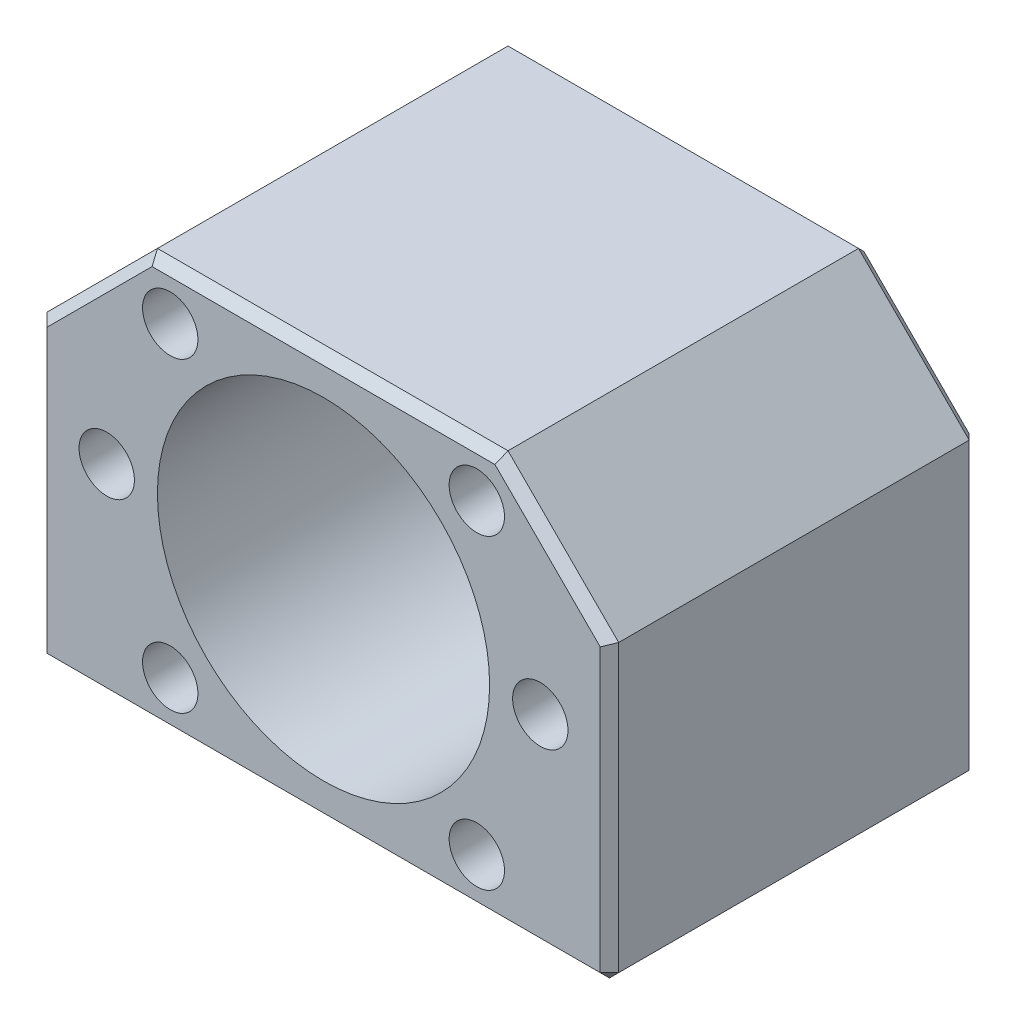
ISO-10303-21;
HEADER;
FILE_DESCRIPTION(('STEP AP214'),'2;1');
FILE_NAME('part.step','',(''),(''),'','','');
FILE_SCHEMA(('AUTOMOTIVE_DESIGN { 1 0 10303 214 1 1 1 1 }'));
ENDSEC;
DATA;
#1=APPLICATION_CONTEXT('core data for automotive mechanical design processes');
#2=APPLICATION_PROTOCOL_DEFINITION('international standard','automotive_design',2000,#1);
#3=PRODUCT_CONTEXT('',#1,'mechanical');
#4=PRODUCT('Part','Part','',(#3));
#5=PRODUCT_RELATED_PRODUCT_CATEGORY('part','',(#4));
#6=PRODUCT_DEFINITION_FORMATION('','',#4);
#7=PRODUCT_DEFINITION_CONTEXT('part definition',#1,'design');
#8=PRODUCT_DEFINITION('design','',#6,#7);
#9=PRODUCT_DEFINITION_SHAPE('','',#8);
#10=(LENGTH_UNIT() NAMED_UNIT(*) SI_UNIT(.MILLI.,.METRE.));
#11=(NAMED_UNIT(*) PLANE_ANGLE_UNIT() SI_UNIT($,.RADIAN.));
#12=(NAMED_UNIT(*) SI_UNIT($,.STERADIAN.) SOLID_ANGLE_UNIT());
#13=UNCERTAINTY_MEASURE_WITH_UNIT(LENGTH_MEASURE(1.E-05),#10,'distance_accuracy_value','');
#14=(GEOMETRIC_REPRESENTATION_CONTEXT(3) GLOBAL_UNCERTAINTY_ASSIGNED_CONTEXT((#13)) GLOBAL_UNIT_ASSIGNED_CONTEXT((#10,
#11,#12)) REPRESENTATION_CONTEXT('',''));
#15=CARTESIAN_POINT('',(0.,0.,0.));
#16=DIRECTION('',(0.,0.,1.));
#17=DIRECTION('',(1.,0.,0.));
#18=AXIS2_PLACEMENT_3D('',#15,#16,#17);
#19=CARTESIAN_POINT('',(-31.,-22.,0.));
#20=DIRECTION('',(-1.,0.,0.));
#21=DIRECTION('',(0.,0.,1.));
#22=AXIS2_PLACEMENT_3D('',#19,#20,#21);
#23=PLANE('',#22);
#24=DIRECTION('',(0.,-1.,0.));
#25=VECTOR('',#24,1.);
#26=CARTESIAN_POINT('',(-31.,-11.,-1.));
#27=LINE('',#26,#25);
#28=CARTESIAN_POINT('',(-31.,10.,-1.));
#29=VERTEX_POINT('',#28);
#30=CARTESIAN_POINT('',(-31.,-21.,-1.));
#31=VERTEX_POINT('',#30);
#32=EDGE_CURVE('E376',#29,#31,#27,.T.);
#33=ORIENTED_EDGE('',*,*,#32,.F.);
#34=DIRECTION('',(0.,0.,1.));
#35=VECTOR('',#34,1.);
#36=CARTESIAN_POINT('',(-31.,10.,0.));
#37=LINE('',#36,#35);
#38=CARTESIAN_POINT('',(-31.,10.,-39.));
#39=VERTEX_POINT('',#38);
#40=EDGE_CURVE('E154',#39,#29,#37,.T.);
#41=ORIENTED_EDGE('',*,*,#40,.F.);
#42=DIRECTION('',(0.,1.,0.));
#43=VECTOR('',#42,1.);
#44=CARTESIAN_POINT('',(-31.,-11.,-39.));
#45=LINE('',#44,#43);
#46=CARTESIAN_POINT('',(-31.,-21.,-39.));
#47=VERTEX_POINT('',#46);
#48=EDGE_CURVE('E418',#47,#39,#45,.T.);
#49=ORIENTED_EDGE('',*,*,#48,.F.);
#50=DIRECTION('',(0.,0.,-1.));
#51=VECTOR('',#50,1.);
#52=CARTESIAN_POINT('',(-31.,-21.,0.));
#53=LINE('',#52,#51);
#54=EDGE_CURVE('E392',#31,#47,#53,.T.);
#55=ORIENTED_EDGE('',*,*,#54,.F.);
#56=EDGE_LOOP('',(#33,#41,#49,#55));
#57=FACE_BOUND('',#56,.T.);
#58=ADVANCED_FACE('F15',(#57),#23,.T.);
#59=CARTESIAN_POINT('',(0.,0.,0.));
#60=DIRECTION('',(0.,0.,-1.));
#61=DIRECTION('',(1.,0.,0.));
#62=AXIS2_PLACEMENT_3D('',#59,#60,#61);
#63=CYLINDRICAL_SURFACE('',#62,18.005);
#64=CARTESIAN_POINT('',(0.,0.,0.));
#65=DIRECTION('',(0.,0.,-1.));
#66=DIRECTION('',(1.,0.,0.));
#67=AXIS2_PLACEMENT_3D('',#64,#65,#66);
#68=CIRCLE('',#67,18.005);
#69=CARTESIAN_POINT('',(18.005,0.,0.));
#70=VERTEX_POINT('',#69);
#71=CARTESIAN_POINT('',(-18.005,0.,0.));
#72=VERTEX_POINT('',#71);
#73=EDGE_CURVE('E173',#70,#72,#68,.T.);
#74=ORIENTED_EDGE('',*,*,#73,.F.);
#75=CARTESIAN_POINT('',(0.,0.,0.));
#76=DIRECTION('',(0.,0.,-1.));
#77=DIRECTION('',(1.,0.,0.));
#78=AXIS2_PLACEMENT_3D('',#75,#76,#77);
#79=CIRCLE('',#78,18.005);
#80=EDGE_CURVE('E177',#72,#70,#79,.T.);
#81=ORIENTED_EDGE('',*,*,#80,.F.);
#82=DIRECTION('',(0.,0.,-1.));
#83=VECTOR('',#82,1.);
#84=CARTESIAN_POINT('',(-18.005,0.,0.));
#85=LINE('',#84,#83);
#86=CARTESIAN_POINT('',(-18.005,0.,-40.));
#87=VERTEX_POINT('',#86);
#88=EDGE_CURVE('E9',#72,#87,#85,.T.);
#89=ORIENTED_EDGE('',*,*,#88,.T.);
#90=CARTESIAN_POINT('',(0.,0.,-40.));
#91=DIRECTION('',(0.,0.,1.));
#92=DIRECTION('',(1.,0.,0.));
#93=AXIS2_PLACEMENT_3D('',#90,#91,#92);
#94=CIRCLE('',#93,18.005);
#95=EDGE_CURVE('E169',#87,#87,#94,.T.);
#96=ORIENTED_EDGE('',*,*,#95,.F.);
#97=ORIENTED_EDGE('',*,*,#88,.F.);
#98=EDGE_LOOP('',(#74,#81,#89,#96,#97));
#99=FACE_BOUND('',#98,.T.);
#100=ADVANCED_FACE('F1027',(#99),#63,.F.);
#101=CARTESIAN_POINT('',(-16.6170093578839,16.6170093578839,-15.));
#102=DIRECTION('',(0.,0.,1.));
#103=DIRECTION('',(1.,0.,0.));
#104=AXIS2_PLACEMENT_3D('',#101,#102,#103);
#105=PLANE('',#104);
#106=CARTESIAN_POINT('',(-16.6170093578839,16.6170093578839,-15.));
#107=DIRECTION('',(0.,0.,-1.));
#108=DIRECTION('',(1.,0.,0.));
#109=AXIS2_PLACEMENT_3D('',#106,#107,#108);
#110=CIRCLE('',#109,3.);
#111=CARTESIAN_POINT('',(-13.6170093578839,16.6170093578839,-15.));
#112=VERTEX_POINT('',#111);
#113=CARTESIAN_POINT('',(-19.6170093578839,16.6170093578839,-15.));
#114=VERTEX_POINT('',#113);
#115=EDGE_CURVE('E25',#112,#114,#110,.T.);
#116=ORIENTED_EDGE('',*,*,#115,.F.);
#117=CARTESIAN_POINT('',(-16.6170093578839,16.6170093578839,-15.));
#118=DIRECTION('',(0.,0.,-1.));
#119=DIRECTION('',(1.,0.,0.));
#120=AXIS2_PLACEMENT_3D('',#117,#118,#119);
#121=CIRCLE('',#120,3.);
#122=EDGE_CURVE('E18',#114,#112,#121,.T.);
#123=ORIENTED_EDGE('',*,*,#122,.F.);
#124=EDGE_LOOP('',(#116,#123));
#125=FACE_BOUND('',#124,.T.);
#126=ADVANCED_FACE('F1035',(#125),#105,.T.);
#127=CARTESIAN_POINT('',(-16.6170093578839,16.6170093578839,0.));
#128=DIRECTION('',(0.,0.,-1.));
#129=DIRECTION('',(1.,0.,0.));
#130=AXIS2_PLACEMENT_3D('',#127,#128,#129);
#131=CYLINDRICAL_SURFACE('',#130,3.);
#132=CARTESIAN_POINT('',(-16.6170093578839,16.6170093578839,0.));
#133=DIRECTION('',(0.,0.,-1.));
#134=DIRECTION('',(1.,0.,0.));
#135=AXIS2_PLACEMENT_3D('',#132,#133,#134);
#136=CIRCLE('',#135,3.);
#137=CARTESIAN_POINT('',(-13.6170093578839,16.6170093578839,0.));
#138=VERTEX_POINT('',#137);
#139=CARTESIAN_POINT('',(-19.6170093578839,16.6170093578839,0.));
#140=VERTEX_POINT('',#139);
#141=EDGE_CURVE('E187',#138,#140,#136,.T.);
#142=ORIENTED_EDGE('',*,*,#141,.F.);
#143=CARTESIAN_POINT('',(-16.6170093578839,16.6170093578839,0.));
#144=DIRECTION('',(0.,0.,-1.));
#145=DIRECTION('',(1.,0.,0.));
#146=AXIS2_PLACEMENT_3D('',#143,#144,#145);
#147=CIRCLE('',#146,3.);
#148=EDGE_CURVE('E191',#140,#138,#147,.T.);
#149=ORIENTED_EDGE('',*,*,#148,.F.);
#150=DIRECTION('',(0.,0.,-1.));
#151=VECTOR('',#150,1.);
#152=CARTESIAN_POINT('',(-19.6170093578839,16.6170093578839,0.));
#153=LINE('',#152,#151);
#154=EDGE_CURVE('E132',#140,#114,#153,.T.);
#155=ORIENTED_EDGE('',*,*,#154,.T.);
#156=ORIENTED_EDGE('',*,*,#122,.T.);
#157=ORIENTED_EDGE('',*,*,#115,.T.);
#158=ORIENTED_EDGE('',*,*,#154,.F.);
#159=EDGE_LOOP('',(#142,#149,#155,#156,#157,#158));
#160=FACE_BOUND('',#159,.T.);
#161=ADVANCED_FACE('F1043',(#160),#131,.F.);
#162=CARTESIAN_POINT('',(16.6170093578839,-16.6170093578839,-15.));
#163=DIRECTION('',(0.,0.,1.));
#164=DIRECTION('',(1.,0.,0.));
#165=AXIS2_PLACEMENT_3D('',#162,#163,#164);
#166=PLANE('',#165);
#167=CARTESIAN_POINT('',(16.6170093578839,-16.6170093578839,-15.));
#168=DIRECTION('',(0.,0.,-1.));
#169=DIRECTION('',(1.,0.,0.));
#170=AXIS2_PLACEMENT_3D('',#167,#168,#169);
#171=CIRCLE('',#170,3.);
#172=CARTESIAN_POINT('',(19.6170093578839,-16.6170093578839,-15.));
#173=VERTEX_POINT('',#172);
#174=CARTESIAN_POINT('',(13.6170093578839,-16.6170093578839,-15.));
#175=VERTEX_POINT('',#174);
#176=EDGE_CURVE('E124',#173,#175,#171,.T.);
#177=ORIENTED_EDGE('',*,*,#176,.F.);
#178=CARTESIAN_POINT('',(16.6170093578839,-16.6170093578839,-15.));
#179=DIRECTION('',(0.,0.,-1.));
#180=DIRECTION('',(1.,0.,0.));
#181=AXIS2_PLACEMENT_3D('',#178,#179,#180);
#182=CIRCLE('',#181,3.);
#183=EDGE_CURVE('E127',#175,#173,#182,.T.);
#184=ORIENTED_EDGE('',*,*,#183,.F.);
#185=EDGE_LOOP('',(#177,#184));
#186=FACE_BOUND('',#185,.T.);
#187=ADVANCED_FACE('F126',(#186),#166,.T.);
#188=CARTESIAN_POINT('',(16.6170093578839,-16.6170093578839,0.));
#189=DIRECTION('',(0.,0.,-1.));
#190=DIRECTION('',(1.,0.,0.));
#191=AXIS2_PLACEMENT_3D('',#188,#189,#190);
#192=CYLINDRICAL_SURFACE('',#191,3.);
#193=CARTESIAN_POINT('',(16.6170093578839,-16.6170093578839,0.));
#194=DIRECTION('',(0.,0.,-1.));
#195=DIRECTION('',(1.,0.,0.));
#196=AXIS2_PLACEMENT_3D('',#193,#194,#195);
#197=CIRCLE('',#196,3.);
#198=CARTESIAN_POINT('',(19.6170093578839,-16.6170093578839,0.));
#199=VERTEX_POINT('',#198);
#200=CARTESIAN_POINT('',(13.6170093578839,-16.6170093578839,0.));
#201=VERTEX_POINT('',#200);
#202=EDGE_CURVE('E160',#199,#201,#197,.T.);
#203=ORIENTED_EDGE('',*,*,#202,.F.);
#204=CARTESIAN_POINT('',(16.6170093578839,-16.6170093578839,0.));
#205=DIRECTION('',(0.,0.,-1.));
#206=DIRECTION('',(1.,0.,0.));
#207=AXIS2_PLACEMENT_3D('',#204,#205,#206);
#208=CIRCLE('',#207,3.);
#209=EDGE_CURVE('E155',#201,#199,#208,.T.);
#210=ORIENTED_EDGE('',*,*,#209,.F.);
#211=DIRECTION('',(0.,0.,-1.));
#212=VECTOR('',#211,1.);
#213=CARTESIAN_POINT('',(13.6170093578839,-16.6170093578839,0.));
#214=LINE('',#213,#212);
#215=EDGE_CURVE('E137',#201,#175,#214,.T.);
#216=ORIENTED_EDGE('',*,*,#215,.T.);
#217=ORIENTED_EDGE('',*,*,#183,.T.);
#218=ORIENTED_EDGE('',*,*,#176,.T.);
#219=ORIENTED_EDGE('',*,*,#215,.F.);
#220=EDGE_LOOP('',(#203,#210,#216,#217,#218,#219));
#221=FACE_BOUND('',#220,.T.);
#222=ADVANCED_FACE('F135',(#221),#192,.F.);
#223=CARTESIAN_POINT('',(23.5,0.,-15.));
#224=DIRECTION('',(0.,0.,1.));
#225=DIRECTION('',(1.,0.,0.));
#226=AXIS2_PLACEMENT_3D('',#223,#224,#225);
#227=PLANE('',#226);
#228=CARTESIAN_POINT('',(23.5,0.,-15.));
#229=DIRECTION('',(0.,0.,-1.));
#230=DIRECTION('',(1.,0.,0.));
#231=AXIS2_PLACEMENT_3D('',#228,#229,#230);
#232=CIRCLE('',#231,3.);
#233=CARTESIAN_POINT('',(26.5,0.,-15.));
#234=VERTEX_POINT('',#233);
#235=CARTESIAN_POINT('',(20.5,0.,-15.));
#236=VERTEX_POINT('',#235);
#237=EDGE_CURVE('E144',#234,#236,#232,.T.);
#238=ORIENTED_EDGE('',*,*,#237,.F.);
#239=CARTESIAN_POINT('',(23.5,0.,-15.));
#240=DIRECTION('',(0.,0.,-1.));
#241=DIRECTION('',(1.,0.,0.));
#242=AXIS2_PLACEMENT_3D('',#239,#240,#241);
#243=CIRCLE('',#242,3.);
#244=EDGE_CURVE('E308',#236,#234,#243,.T.);
#245=ORIENTED_EDGE('',*,*,#244,.F.);
#246=EDGE_LOOP('',(#238,#245));
#247=FACE_BOUND('',#246,.T.);
#248=ADVANCED_FACE('F1059',(#247),#227,.T.);
#249=CARTESIAN_POINT('',(23.5,0.,0.));
#250=DIRECTION('',(0.,0.,-1.));
#251=DIRECTION('',(1.,0.,0.));
#252=AXIS2_PLACEMENT_3D('',#249,#250,#251);
#253=CYLINDRICAL_SURFACE('',#252,3.);
#254=CARTESIAN_POINT('',(23.5,0.,0.));
#255=DIRECTION('',(0.,0.,-1.));
#256=DIRECTION('',(1.,0.,0.));
#257=AXIS2_PLACEMENT_3D('',#254,#255,#256);
#258=CIRCLE('',#257,3.);
#259=CARTESIAN_POINT('',(26.5,0.,0.));
#260=VERTEX_POINT('',#259);
#261=CARTESIAN_POINT('',(20.5,0.,0.));
#262=VERTEX_POINT('',#261);
#263=EDGE_CURVE('E159',#260,#262,#258,.T.);
#264=ORIENTED_EDGE('',*,*,#263,.F.);
#265=CARTESIAN_POINT('',(23.5,0.,0.));
#266=DIRECTION('',(0.,0.,-1.));
#267=DIRECTION('',(1.,0.,0.));
#268=AXIS2_PLACEMENT_3D('',#265,#266,#267);
#269=CIRCLE('',#268,3.);
#270=EDGE_CURVE('E220',#262,#260,#269,.T.);
#271=ORIENTED_EDGE('',*,*,#270,.F.);
#272=DIRECTION('',(0.,0.,-1.));
#273=VECTOR('',#272,1.);
#274=CARTESIAN_POINT('',(20.5,0.,0.));
#275=LINE('',#274,#273);
#276=EDGE_CURVE('E305',#262,#236,#275,.T.);
#277=ORIENTED_EDGE('',*,*,#276,.T.);
#278=ORIENTED_EDGE('',*,*,#244,.T.);
#279=ORIENTED_EDGE('',*,*,#237,.T.);
#280=ORIENTED_EDGE('',*,*,#276,.F.);
#281=EDGE_LOOP('',(#264,#271,#277,#278,#279,#280));
#282=FACE_BOUND('',#281,.T.);
#283=ADVANCED_FACE('F1067',(#282),#253,.F.);
#284=CARTESIAN_POINT('',(-23.5,0.,-15.));
#285=DIRECTION('',(0.,0.,1.));
#286=DIRECTION('',(1.,0.,0.));
#287=AXIS2_PLACEMENT_3D('',#284,#285,#286);
#288=PLANE('',#287);
#289=CARTESIAN_POINT('',(-23.5,0.,-15.));
#290=DIRECTION('',(0.,0.,-1.));
#291=DIRECTION('',(1.,0.,0.));
#292=AXIS2_PLACEMENT_3D('',#289,#290,#291);
#293=CIRCLE('',#292,3.);
#294=CARTESIAN_POINT('',(-20.5,0.,-15.));
#295=VERTEX_POINT('',#294);
#296=CARTESIAN_POINT('',(-26.5,0.,-15.));
#297=VERTEX_POINT('',#296);
#298=EDGE_CURVE('E182',#295,#297,#293,.T.);
#299=ORIENTED_EDGE('',*,*,#298,.F.);
#300=CARTESIAN_POINT('',(-23.5,0.,-15.));
#301=DIRECTION('',(0.,0.,-1.));
#302=DIRECTION('',(1.,0.,0.));
#303=AXIS2_PLACEMENT_3D('',#300,#301,#302);
#304=CIRCLE('',#303,3.);
#305=EDGE_CURVE('E178',#297,#295,#304,.T.);
#306=ORIENTED_EDGE('',*,*,#305,.F.);
#307=EDGE_LOOP('',(#299,#306));
#308=FACE_BOUND('',#307,.T.);
#309=ADVANCED_FACE('F1076',(#308),#288,.T.);
#310=CARTESIAN_POINT('',(-23.5,0.,0.));
#311=DIRECTION('',(0.,0.,-1.));
#312=DIRECTION('',(1.,0.,0.));
#313=AXIS2_PLACEMENT_3D('',#310,#311,#312);
#314=CYLINDRICAL_SURFACE('',#313,3.);
#315=CARTESIAN_POINT('',(-23.5,0.,0.));
#316=DIRECTION('',(0.,0.,-1.));
#317=DIRECTION('',(1.,0.,0.));
#318=AXIS2_PLACEMENT_3D('',#315,#316,#317);
#319=CIRCLE('',#318,3.);
#320=CARTESIAN_POINT('',(-20.5,0.,0.));
#321=VERTEX_POINT('',#320);
#322=CARTESIAN_POINT('',(-26.5,0.,0.));
#323=VERTEX_POINT('',#322);
#324=EDGE_CURVE('E229',#321,#323,#319,.T.);
#325=ORIENTED_EDGE('',*,*,#324,.F.);
#326=CARTESIAN_POINT('',(-23.5,0.,0.));
#327=DIRECTION('',(0.,0.,-1.));
#328=DIRECTION('',(1.,0.,0.));
#329=AXIS2_PLACEMENT_3D('',#326,#327,#328);
#330=CIRCLE('',#329,3.);
#331=EDGE_CURVE('E235',#323,#321,#330,.T.);
#332=ORIENTED_EDGE('',*,*,#331,.F.);
#333=DIRECTION('',(0.,0.,-1.));
#334=VECTOR('',#333,1.);
#335=CARTESIAN_POINT('',(-26.5,0.,0.));
#336=LINE('',#335,#334);
#337=EDGE_CURVE('E183',#323,#297,#336,.T.);
#338=ORIENTED_EDGE('',*,*,#337,.T.);
#339=ORIENTED_EDGE('',*,*,#305,.T.);
#340=ORIENTED_EDGE('',*,*,#298,.T.);
#341=ORIENTED_EDGE('',*,*,#337,.F.);
#342=EDGE_LOOP('',(#325,#332,#338,#339,#340,#341));
#343=FACE_BOUND('',#342,.T.);
#344=ADVANCED_FACE('F1084',(#343),#314,.F.);
#345=CARTESIAN_POINT('',(-16.6170093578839,-16.6170093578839,-15.));
#346=DIRECTION('',(0.,0.,1.));
#347=DIRECTION('',(1.,0.,0.));
#348=AXIS2_PLACEMENT_3D('',#345,#346,#347);
#349=PLANE('',#348);
#350=CARTESIAN_POINT('',(-16.6170093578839,-16.6170093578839,-15.));
#351=DIRECTION('',(0.,0.,-1.));
#352=DIRECTION('',(1.,0.,0.));
#353=AXIS2_PLACEMENT_3D('',#350,#351,#352);
#354=CIRCLE('',#353,3.);
#355=CARTESIAN_POINT('',(-13.6170093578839,-16.6170093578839,-15.));
#356=VERTEX_POINT('',#355);
#357=CARTESIAN_POINT('',(-19.6170093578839,-16.6170093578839,-15.));
#358=VERTEX_POINT('',#357);
#359=EDGE_CURVE('E298',#356,#358,#354,.T.);
#360=ORIENTED_EDGE('',*,*,#359,.F.);
#361=CARTESIAN_POINT('',(-16.6170093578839,-16.6170093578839,-15.));
#362=DIRECTION('',(0.,0.,-1.));
#363=DIRECTION('',(1.,0.,0.));
#364=AXIS2_PLACEMENT_3D('',#361,#362,#363);
#365=CIRCLE('',#364,3.);
#366=EDGE_CURVE('E297',#358,#356,#365,.T.);
#367=ORIENTED_EDGE('',*,*,#366,.F.);
#368=EDGE_LOOP('',(#360,#367));
#369=FACE_BOUND('',#368,.T.);
#370=ADVANCED_FACE('F1093',(#369),#349,.T.);
#371=CARTESIAN_POINT('',(-16.6170093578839,-16.6170093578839,0.));
#372=DIRECTION('',(0.,0.,-1.));
#373=DIRECTION('',(1.,0.,0.));
#374=AXIS2_PLACEMENT_3D('',#371,#372,#373);
#375=CYLINDRICAL_SURFACE('',#374,3.);
#376=CARTESIAN_POINT('',(-16.6170093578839,-16.6170093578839,0.));
#377=DIRECTION('',(0.,0.,-1.));
#378=DIRECTION('',(1.,0.,0.));
#379=AXIS2_PLACEMENT_3D('',#376,#377,#378);
#380=CIRCLE('',#379,3.);
#381=CARTESIAN_POINT('',(-13.6170093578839,-16.6170093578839,0.));
#382=VERTEX_POINT('',#381);
#383=CARTESIAN_POINT('',(-19.6170093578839,-16.6170093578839,0.));
#384=VERTEX_POINT('',#383);
#385=EDGE_CURVE('E239',#382,#384,#380,.T.);
#386=ORIENTED_EDGE('',*,*,#385,.F.);
#387=CARTESIAN_POINT('',(-16.6170093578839,-16.6170093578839,0.));
#388=DIRECTION('',(0.,0.,-1.));
#389=DIRECTION('',(1.,0.,0.));
#390=AXIS2_PLACEMENT_3D('',#387,#388,#389);
#391=CIRCLE('',#390,3.);
#392=EDGE_CURVE('E202',#384,#382,#391,.T.);
#393=ORIENTED_EDGE('',*,*,#392,.F.);
#394=DIRECTION('',(0.,0.,-1.));
#395=VECTOR('',#394,1.);
#396=CARTESIAN_POINT('',(-19.6170093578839,-16.6170093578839,0.));
#397=LINE('',#396,#395);
#398=EDGE_CURVE('E293',#384,#358,#397,.T.);
#399=ORIENTED_EDGE('',*,*,#398,.T.);
#400=ORIENTED_EDGE('',*,*,#366,.T.);
#401=ORIENTED_EDGE('',*,*,#359,.T.);
#402=ORIENTED_EDGE('',*,*,#398,.F.);
#403=EDGE_LOOP('',(#386,#393,#399,#400,#401,#402));
#404=FACE_BOUND('',#403,.T.);
#405=ADVANCED_FACE('F1102',(#404),#375,.F.);
#406=CARTESIAN_POINT('',(16.6170093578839,16.6170093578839,-15.));
#407=DIRECTION('',(0.,0.,1.));
#408=DIRECTION('',(1.,0.,0.));
#409=AXIS2_PLACEMENT_3D('',#406,#407,#408);
#410=PLANE('',#409);
#411=CARTESIAN_POINT('',(16.6170093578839,16.6170093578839,-15.));
#412=DIRECTION('',(0.,0.,-1.));
#413=DIRECTION('',(1.,0.,0.));
#414=AXIS2_PLACEMENT_3D('',#411,#412,#413);
#415=CIRCLE('',#414,3.);
#416=CARTESIAN_POINT('',(19.6170093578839,16.6170093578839,-15.));
#417=VERTEX_POINT('',#416);
#418=CARTESIAN_POINT('',(13.6170093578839,16.6170093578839,-15.));
#419=VERTEX_POINT('',#418);
#420=EDGE_CURVE('E290',#417,#419,#415,.T.);
#421=ORIENTED_EDGE('',*,*,#420,.F.);
#422=CARTESIAN_POINT('',(16.6170093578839,16.6170093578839,-15.));
#423=DIRECTION('',(0.,0.,-1.));
#424=DIRECTION('',(1.,0.,0.));
#425=AXIS2_PLACEMENT_3D('',#422,#423,#424);
#426=CIRCLE('',#425,3.);
#427=EDGE_CURVE('E286',#419,#417,#426,.T.);
#428=ORIENTED_EDGE('',*,*,#427,.F.);
#429=EDGE_LOOP('',(#421,#428));
#430=FACE_BOUND('',#429,.T.);
#431=ADVANCED_FACE('F1111',(#430),#410,.T.);
#432=CARTESIAN_POINT('',(16.6170093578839,16.6170093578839,0.));
#433=DIRECTION('',(0.,0.,-1.));
#434=DIRECTION('',(1.,0.,0.));
#435=AXIS2_PLACEMENT_3D('',#432,#433,#434);
#436=CYLINDRICAL_SURFACE('',#435,3.);
#437=CARTESIAN_POINT('',(16.6170093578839,16.6170093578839,0.));
#438=DIRECTION('',(0.,0.,-1.));
#439=DIRECTION('',(1.,0.,0.));
#440=AXIS2_PLACEMENT_3D('',#437,#438,#439);
#441=CIRCLE('',#440,3.);
#442=CARTESIAN_POINT('',(19.6170093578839,16.6170093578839,0.));
#443=VERTEX_POINT('',#442);
#444=CARTESIAN_POINT('',(13.6170093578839,16.6170093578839,0.));
#445=VERTEX_POINT('',#444);
#446=EDGE_CURVE('E197',#443,#445,#441,.T.);
#447=ORIENTED_EDGE('',*,*,#446,.F.);
#448=CARTESIAN_POINT('',(16.6170093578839,16.6170093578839,0.));
#449=DIRECTION('',(0.,0.,-1.));
#450=DIRECTION('',(1.,0.,0.));
#451=AXIS2_PLACEMENT_3D('',#448,#449,#450);
#452=CIRCLE('',#451,3.);
#453=EDGE_CURVE('E201',#445,#443,#452,.T.);
#454=ORIENTED_EDGE('',*,*,#453,.F.);
#455=DIRECTION('',(0.,0.,-1.));
#456=VECTOR('',#455,1.);
#457=CARTESIAN_POINT('',(13.6170093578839,16.6170093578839,0.));
#458=LINE('',#457,#456);
#459=EDGE_CURVE('E281',#445,#419,#458,.T.);
#460=ORIENTED_EDGE('',*,*,#459,.T.);
#461=ORIENTED_EDGE('',*,*,#427,.T.);
#462=ORIENTED_EDGE('',*,*,#420,.T.);
#463=ORIENTED_EDGE('',*,*,#459,.F.);
#464=EDGE_LOOP('',(#447,#454,#460,#461,#462,#463));
#465=FACE_BOUND('',#464,.T.);
#466=ADVANCED_FACE('F1120',(#465),#436,.F.);
#467=CARTESIAN_POINT('',(24.,-7.,-8.));
#468=DIRECTION('',(0.,-1.,0.));
#469=DIRECTION('',(0.,0.,-1.));
#470=AXIS2_PLACEMENT_3D('',#467,#468,#469);
#471=PLANE('',#470);
#472=CARTESIAN_POINT('',(24.,-7.,-8.));
#473=DIRECTION('',(0.,1.,0.));
#474=DIRECTION('',(1.,0.,0.));
#475=AXIS2_PLACEMENT_3D('',#472,#473,#474);
#476=CIRCLE('',#475,3.);
#477=CARTESIAN_POINT('',(27.,-7.,-8.));
#478=VERTEX_POINT('',#477);
#479=CARTESIAN_POINT('',(21.,-7.,-8.));
#480=VERTEX_POINT('',#479);
#481=EDGE_CURVE('E277',#478,#480,#476,.T.);
#482=ORIENTED_EDGE('',*,*,#481,.F.);
#483=CARTESIAN_POINT('',(24.,-7.,-8.));
#484=DIRECTION('',(0.,1.,0.));
#485=DIRECTION('',(1.,0.,0.));
#486=AXIS2_PLACEMENT_3D('',#483,#484,#485);
#487=CIRCLE('',#486,3.);
#488=EDGE_CURVE('E282',#480,#478,#487,.T.);
#489=ORIENTED_EDGE('',*,*,#488,.F.);
#490=EDGE_LOOP('',(#482,#489));
#491=FACE_BOUND('',#490,.T.);
#492=ADVANCED_FACE('F1129',(#491),#471,.T.);
#493=CARTESIAN_POINT('',(24.,-22.,-8.));
#494=DIRECTION('',(0.,1.,0.));
#495=DIRECTION('',(1.,0.,0.));
#496=AXIS2_PLACEMENT_3D('',#493,#494,#495);
#497=CYLINDRICAL_SURFACE('',#496,3.);
#498=CARTESIAN_POINT('',(24.,-22.,-8.));
#499=DIRECTION('',(0.,1.,0.));
#500=DIRECTION('',(1.,0.,0.));
#501=AXIS2_PLACEMENT_3D('',#498,#499,#500);
#502=CIRCLE('',#501,3.);
#503=CARTESIAN_POINT('',(27.,-22.,-8.));
#504=VERTEX_POINT('',#503);
#505=CARTESIAN_POINT('',(21.,-22.,-8.));
#506=VERTEX_POINT('',#505);
#507=EDGE_CURVE('E221',#504,#506,#502,.T.);
#508=ORIENTED_EDGE('',*,*,#507,.F.);
#509=CARTESIAN_POINT('',(24.,-22.,-8.));
#510=DIRECTION('',(0.,1.,0.));
#511=DIRECTION('',(1.,0.,0.));
#512=AXIS2_PLACEMENT_3D('',#509,#510,#511);
#513=CIRCLE('',#512,3.);
#514=EDGE_CURVE('E225',#506,#504,#513,.T.);
#515=ORIENTED_EDGE('',*,*,#514,.F.);
#516=DIRECTION('',(0.,1.,0.));
#517=VECTOR('',#516,1.);
#518=CARTESIAN_POINT('',(21.,-22.,-8.));
#519=LINE('',#518,#517);
#520=EDGE_CURVE('E212',#506,#480,#519,.T.);
#521=ORIENTED_EDGE('',*,*,#520,.T.);
#522=ORIENTED_EDGE('',*,*,#488,.T.);
#523=ORIENTED_EDGE('',*,*,#481,.T.);
#524=ORIENTED_EDGE('',*,*,#520,.F.);
#525=EDGE_LOOP('',(#508,#515,#521,#522,#523,#524));
#526=FACE_BOUND('',#525,.T.);
#527=ADVANCED_FACE('F1137',(#526),#497,.F.);
#528=CARTESIAN_POINT('',(24.,-7.,-32.));
#529=DIRECTION('',(0.,-1.,0.));
#530=DIRECTION('',(0.,0.,-1.));
#531=AXIS2_PLACEMENT_3D('',#528,#529,#530);
#532=PLANE('',#531);
#533=CARTESIAN_POINT('',(24.,-7.,-32.));
#534=DIRECTION('',(0.,1.,0.));
#535=DIRECTION('',(1.,0.,0.));
#536=AXIS2_PLACEMENT_3D('',#533,#534,#535);
#537=CIRCLE('',#536,3.);
#538=CARTESIAN_POINT('',(27.,-7.,-32.));
#539=VERTEX_POINT('',#538);
#540=CARTESIAN_POINT('',(21.,-7.,-32.));
#541=VERTEX_POINT('',#540);
#542=EDGE_CURVE('E209',#539,#541,#537,.T.);
#543=ORIENTED_EDGE('',*,*,#542,.F.);
#544=CARTESIAN_POINT('',(24.,-7.,-32.));
#545=DIRECTION('',(0.,1.,0.));
#546=DIRECTION('',(1.,0.,0.));
#547=AXIS2_PLACEMENT_3D('',#544,#545,#546);
#548=CIRCLE('',#547,3.);
#549=EDGE_CURVE('E213',#541,#539,#548,.T.);
#550=ORIENTED_EDGE('',*,*,#549,.F.);
#551=EDGE_LOOP('',(#543,#550));
#552=FACE_BOUND('',#551,.T.);
#553=ADVANCED_FACE('F1148',(#552),#532,.T.);
#554=CARTESIAN_POINT('',(24.,-22.,-32.));
#555=DIRECTION('',(0.,1.,0.));
#556=DIRECTION('',(1.,0.,0.));
#557=AXIS2_PLACEMENT_3D('',#554,#555,#556);
#558=CYLINDRICAL_SURFACE('',#557,3.);
#559=CARTESIAN_POINT('',(24.,-22.,-32.));
#560=DIRECTION('',(0.,1.,0.));
#561=DIRECTION('',(1.,0.,0.));
#562=AXIS2_PLACEMENT_3D('',#559,#560,#561);
#563=CIRCLE('',#562,3.);
#564=CARTESIAN_POINT('',(27.,-22.,-32.));
#565=VERTEX_POINT('',#564);
#566=CARTESIAN_POINT('',(21.,-22.,-32.));
#567=VERTEX_POINT('',#566);
#568=EDGE_CURVE('E234',#565,#567,#563,.T.);
#569=ORIENTED_EDGE('',*,*,#568,.F.);
#570=CARTESIAN_POINT('',(24.,-22.,-32.));
#571=DIRECTION('',(0.,1.,0.));
#572=DIRECTION('',(1.,0.,0.));
#573=AXIS2_PLACEMENT_3D('',#570,#571,#572);
#574=CIRCLE('',#573,3.);
#575=EDGE_CURVE('E230',#567,#565,#574,.T.);
#576=ORIENTED_EDGE('',*,*,#575,.F.);
#577=DIRECTION('',(0.,1.,0.));
#578=VECTOR('',#577,1.);
#579=CARTESIAN_POINT('',(21.,-22.,-32.));
#580=LINE('',#579,#578);
#581=EDGE_CURVE('E257',#567,#541,#580,.T.);
#582=ORIENTED_EDGE('',*,*,#581,.T.);
#583=ORIENTED_EDGE('',*,*,#549,.T.);
#584=ORIENTED_EDGE('',*,*,#542,.T.);
#585=ORIENTED_EDGE('',*,*,#581,.F.);
#586=EDGE_LOOP('',(#569,#576,#582,#583,#584,#585));
#587=FACE_BOUND('',#586,.T.);
#588=ADVANCED_FACE('F1143',(#587),#558,.F.);
#589=CARTESIAN_POINT('',(-24.,-7.,-8.));
#590=DIRECTION('',(0.,-1.,0.));
#591=DIRECTION('',(0.,0.,-1.));
#592=AXIS2_PLACEMENT_3D('',#589,#590,#591);
#593=PLANE('',#592);
#594=CARTESIAN_POINT('',(-24.,-7.,-8.));
#595=DIRECTION('',(0.,1.,0.));
#596=DIRECTION('',(1.,0.,0.));
#597=AXIS2_PLACEMENT_3D('',#594,#595,#596);
#598=CIRCLE('',#597,3.);
#599=CARTESIAN_POINT('',(-21.,-7.,-8.));
#600=VERTEX_POINT('',#599);
#601=CARTESIAN_POINT('',(-27.,-7.,-8.));
#602=VERTEX_POINT('',#601);
#603=EDGE_CURVE('E271',#600,#602,#598,.T.);
#604=ORIENTED_EDGE('',*,*,#603,.F.);
#605=CARTESIAN_POINT('',(-24.,-7.,-8.));
#606=DIRECTION('',(0.,1.,0.));
#607=DIRECTION('',(1.,0.,0.));
#608=AXIS2_PLACEMENT_3D('',#605,#606,#607);
#609=CIRCLE('',#608,3.);
#610=EDGE_CURVE('E269',#602,#600,#609,.T.);
#611=ORIENTED_EDGE('',*,*,#610,.F.);
#612=EDGE_LOOP('',(#604,#611));
#613=FACE_BOUND('',#612,.T.);
#614=ADVANCED_FACE('F1147',(#613),#593,.T.);
#615=CARTESIAN_POINT('',(-24.,-22.,-8.));
#616=DIRECTION('',(0.,1.,0.));
#617=DIRECTION('',(1.,0.,0.));
#618=AXIS2_PLACEMENT_3D('',#615,#616,#617);
#619=CYLINDRICAL_SURFACE('',#618,3.);
#620=CARTESIAN_POINT('',(-24.,-22.,-8.));
#621=DIRECTION('',(0.,1.,0.));
#622=DIRECTION('',(1.,0.,0.));
#623=AXIS2_PLACEMENT_3D('',#620,#621,#622);
#624=CIRCLE('',#623,3.);
#625=CARTESIAN_POINT('',(-21.,-22.,-8.));
#626=VERTEX_POINT('',#625);
#627=CARTESIAN_POINT('',(-27.,-22.,-8.));
#628=VERTEX_POINT('',#627);
#629=EDGE_CURVE('E233',#626,#628,#624,.T.);
#630=ORIENTED_EDGE('',*,*,#629,.F.);
#631=CARTESIAN_POINT('',(-24.,-22.,-8.));
#632=DIRECTION('',(0.,1.,0.));
#633=DIRECTION('',(1.,0.,0.));
#634=AXIS2_PLACEMENT_3D('',#631,#632,#633);
#635=CIRCLE('',#634,3.);
#636=EDGE_CURVE('E251',#628,#626,#635,.T.);
#637=ORIENTED_EDGE('',*,*,#636,.F.);
#638=DIRECTION('',(0.,1.,0.));
#639=VECTOR('',#638,1.);
#640=CARTESIAN_POINT('',(-27.,-22.,-8.));
#641=LINE('',#640,#639);
#642=EDGE_CURVE('E265',#628,#602,#641,.T.);
#643=ORIENTED_EDGE('',*,*,#642,.T.);
#644=ORIENTED_EDGE('',*,*,#610,.T.);
#645=ORIENTED_EDGE('',*,*,#603,.T.);
#646=ORIENTED_EDGE('',*,*,#642,.F.);
#647=EDGE_LOOP('',(#630,#637,#643,#644,#645,#646));
#648=FACE_BOUND('',#647,.T.);
#649=ADVANCED_FACE('F1157',(#648),#619,.F.);
#650=CARTESIAN_POINT('',(-24.,-7.,-32.));
#651=DIRECTION('',(0.,-1.,0.));
#652=DIRECTION('',(0.,0.,-1.));
#653=AXIS2_PLACEMENT_3D('',#650,#651,#652);
#654=PLANE('',#653);
#655=CARTESIAN_POINT('',(-24.,-7.,-32.));
#656=DIRECTION('',(0.,1.,0.));
#657=DIRECTION('',(1.,0.,0.));
#658=AXIS2_PLACEMENT_3D('',#655,#656,#657);
#659=CIRCLE('',#658,3.);
#660=CARTESIAN_POINT('',(-21.,-7.,-32.));
#661=VERTEX_POINT('',#660);
#662=CARTESIAN_POINT('',(-27.,-7.,-32.));
#663=VERTEX_POINT('',#662);
#664=EDGE_CURVE('E270',#661,#663,#659,.T.);
#665=ORIENTED_EDGE('',*,*,#664,.F.);
#666=CARTESIAN_POINT('',(-24.,-7.,-32.));
#667=DIRECTION('',(0.,1.,0.));
#668=DIRECTION('',(1.,0.,0.));
#669=AXIS2_PLACEMENT_3D('',#666,#667,#668);
#670=CIRCLE('',#669,3.);
#671=EDGE_CURVE('E263',#663,#661,#670,.T.);
#672=ORIENTED_EDGE('',*,*,#671,.F.);
#673=EDGE_LOOP('',(#665,#672));
#674=FACE_BOUND('',#673,.T.);
#675=ADVANCED_FACE('F1166',(#674),#654,.T.);
#676=CARTESIAN_POINT('',(-24.,-22.,-32.));
#677=DIRECTION('',(0.,1.,0.));
#678=DIRECTION('',(1.,0.,0.));
#679=AXIS2_PLACEMENT_3D('',#676,#677,#678);
#680=CYLINDRICAL_SURFACE('',#679,3.);
#681=CARTESIAN_POINT('',(-24.,-22.,-32.));
#682=DIRECTION('',(0.,1.,0.));
#683=DIRECTION('',(1.,0.,0.));
#684=AXIS2_PLACEMENT_3D('',#681,#682,#683);
#685=CIRCLE('',#684,3.);
#686=CARTESIAN_POINT('',(-21.,-22.,-32.));
#687=VERTEX_POINT('',#686);
#688=CARTESIAN_POINT('',(-27.,-22.,-32.));
#689=VERTEX_POINT('',#688);
#690=EDGE_CURVE('E196',#687,#689,#685,.T.);
#691=ORIENTED_EDGE('',*,*,#690,.F.);
#692=CARTESIAN_POINT('',(-24.,-22.,-32.));
#693=DIRECTION('',(0.,1.,0.));
#694=DIRECTION('',(1.,0.,0.));
#695=AXIS2_PLACEMENT_3D('',#692,#693,#694);
#696=CIRCLE('',#695,3.);
#697=EDGE_CURVE('E192',#689,#687,#696,.T.);
#698=ORIENTED_EDGE('',*,*,#697,.F.);
#699=DIRECTION('',(0.,1.,0.));
#700=VECTOR('',#699,1.);
#701=CARTESIAN_POINT('',(-27.,-22.,-32.));
#702=LINE('',#701,#700);
#703=EDGE_CURVE('E195',#689,#663,#702,.T.);
#704=ORIENTED_EDGE('',*,*,#703,.T.);
#705=ORIENTED_EDGE('',*,*,#671,.T.);
#706=ORIENTED_EDGE('',*,*,#664,.T.);
#707=ORIENTED_EDGE('',*,*,#703,.F.);
#708=EDGE_LOOP('',(#691,#698,#704,#705,#706,#707));
#709=FACE_BOUND('',#708,.T.);
#710=ADVANCED_FACE('F1175',(#709),#680,.F.);
#711=CARTESIAN_POINT('',(31.,-22.,0.));
#712=DIRECTION('',(0.,-1.,0.));
#713=DIRECTION('',(0.,0.,-1.));
#714=AXIS2_PLACEMENT_3D('',#711,#712,#713);
#715=PLANE('',#714);
#716=ORIENTED_EDGE('',*,*,#690,.T.);
#717=ORIENTED_EDGE('',*,*,#697,.T.);
#718=EDGE_LOOP('',(#716,#717));
#719=FACE_BOUND('',#718,.T.);
#720=ORIENTED_EDGE('',*,*,#629,.T.);
#721=ORIENTED_EDGE('',*,*,#636,.T.);
#722=EDGE_LOOP('',(#720,#721));
#723=FACE_BOUND('',#722,.T.);
#724=ORIENTED_EDGE('',*,*,#568,.T.);
#725=ORIENTED_EDGE('',*,*,#575,.T.);
#726=EDGE_LOOP('',(#724,#725));
#727=FACE_BOUND('',#726,.T.);
#728=ORIENTED_EDGE('',*,*,#507,.T.);
#729=ORIENTED_EDGE('',*,*,#514,.T.);
#730=EDGE_LOOP('',(#728,#729));
#731=FACE_BOUND('',#730,.T.);
#732=DIRECTION('',(0.,0.,1.));
#733=VECTOR('',#732,1.);
#734=CARTESIAN_POINT('',(-30.,-22.,0.));
#735=LINE('',#734,#733);
#736=CARTESIAN_POINT('',(-30.,-22.,-39.));
#737=VERTEX_POINT('',#736);
#738=CARTESIAN_POINT('',(-30.,-22.,-1.));
#739=VERTEX_POINT('',#738);
#740=EDGE_CURVE('E388',#737,#739,#735,.T.);
#741=ORIENTED_EDGE('',*,*,#740,.F.);
#742=DIRECTION('',(-1.,0.,0.));
#743=VECTOR('',#742,1.);
#744=CARTESIAN_POINT('',(15.5,-22.,-39.));
#745=LINE('',#744,#743);
#746=CARTESIAN_POINT('',(30.,-22.,-39.));
#747=VERTEX_POINT('',#746);
#748=EDGE_CURVE('E426',#747,#737,#745,.T.);
#749=ORIENTED_EDGE('',*,*,#748,.F.);
#750=DIRECTION('',(0.,0.,-1.));
#751=VECTOR('',#750,1.);
#752=CARTESIAN_POINT('',(30.,-22.,0.));
#753=LINE('',#752,#751);
#754=CARTESIAN_POINT('',(30.,-22.,-1.));
#755=VERTEX_POINT('',#754);
#756=EDGE_CURVE('E437',#755,#747,#753,.T.);
#757=ORIENTED_EDGE('',*,*,#756,.F.);
#758=DIRECTION('',(1.,0.,0.));
#759=VECTOR('',#758,1.);
#760=CARTESIAN_POINT('',(15.5,-22.,-1.));
#761=LINE('',#760,#759);
#762=EDGE_CURVE('E410',#739,#755,#761,.T.);
#763=ORIENTED_EDGE('',*,*,#762,.F.);
#764=EDGE_LOOP('',(#741,#749,#757,#763));
#765=FACE_BOUND('',#764,.T.);
#766=ADVANCED_FACE('F1181',(#719,#723,#727,#731,#765),#715,.T.);
#767=CARTESIAN_POINT('',(0.,0.,0.));
#768=DIRECTION('',(0.,0.,1.));
#769=DIRECTION('',(1.,0.,0.));
#770=AXIS2_PLACEMENT_3D('',#767,#768,#769);
#771=PLANE('',#770);
#772=ORIENTED_EDGE('',*,*,#446,.T.);
#773=ORIENTED_EDGE('',*,*,#453,.T.);
#774=EDGE_LOOP('',(#772,#773));
#775=FACE_BOUND('',#774,.T.);
#776=ORIENTED_EDGE('',*,*,#385,.T.);
#777=ORIENTED_EDGE('',*,*,#392,.T.);
#778=EDGE_LOOP('',(#776,#777));
#779=FACE_BOUND('',#778,.T.);
#780=ORIENTED_EDGE('',*,*,#324,.T.);
#781=ORIENTED_EDGE('',*,*,#331,.T.);
#782=EDGE_LOOP('',(#780,#781));
#783=FACE_BOUND('',#782,.T.);
#784=ORIENTED_EDGE('',*,*,#263,.T.);
#785=ORIENTED_EDGE('',*,*,#270,.T.);
#786=EDGE_LOOP('',(#784,#785));
#787=FACE_BOUND('',#786,.T.);
#788=ORIENTED_EDGE('',*,*,#202,.T.);
#789=ORIENTED_EDGE('',*,*,#209,.T.);
#790=EDGE_LOOP('',(#788,#789));
#791=FACE_BOUND('',#790,.T.);
#792=ORIENTED_EDGE('',*,*,#141,.T.);
#793=ORIENTED_EDGE('',*,*,#148,.T.);
#794=EDGE_LOOP('',(#792,#793));
#795=FACE_BOUND('',#794,.T.);
#796=ORIENTED_EDGE('',*,*,#73,.T.);
#797=ORIENTED_EDGE('',*,*,#80,.T.);
#798=EDGE_LOOP('',(#796,#797));
#799=FACE_BOUND('',#798,.T.);
#800=DIRECTION('',(0.,1.,0.));
#801=VECTOR('',#800,1.);
#802=CARTESIAN_POINT('',(-30.,-11.,0.));
#803=LINE('',#802,#801);
#804=CARTESIAN_POINT('',(-30.,-21.,0.));
#805=VERTEX_POINT('',#804);
#806=CARTESIAN_POINT('',(-30.,9.58578643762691,0.));
#807=VERTEX_POINT('',#806);
#808=EDGE_CURVE('E377',#805,#807,#803,.T.);
#809=ORIENTED_EDGE('',*,*,#808,.F.);
#810=DIRECTION('',(-1.,0.,0.));
#811=VECTOR('',#810,1.);
#812=CARTESIAN_POINT('',(15.5,-21.,0.));
#813=LINE('',#812,#811);
#814=CARTESIAN_POINT('',(30.,-21.,0.));
#815=VERTEX_POINT('',#814);
#816=EDGE_CURVE('E406',#815,#805,#813,.T.);
#817=ORIENTED_EDGE('',*,*,#816,.F.);
#818=DIRECTION('',(0.,-1.,0.));
#819=VECTOR('',#818,1.);
#820=CARTESIAN_POINT('',(30.,11.,0.));
#821=LINE('',#820,#819);
#822=CARTESIAN_POINT('',(30.,9.58578643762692,0.));
#823=VERTEX_POINT('',#822);
#824=EDGE_CURVE('E444',#823,#815,#821,.T.);
#825=ORIENTED_EDGE('',*,*,#824,.F.);
#826=DIRECTION('',(0.707106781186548,-0.707106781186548,0.));
#827=VECTOR('',#826,1.);
#828=CARTESIAN_POINT('',(22.0428932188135,17.5428932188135,0.));
#829=LINE('',#828,#827);
#830=CARTESIAN_POINT('',(18.5857864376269,21.,0.));
#831=VERTEX_POINT('',#830);
#832=EDGE_CURVE('E489',#831,#823,#829,.T.);
#833=ORIENTED_EDGE('',*,*,#832,.F.);
#834=DIRECTION('',(1.,0.,0.));
#835=VECTOR('',#834,1.);
#836=CARTESIAN_POINT('',(-15.5,21.,0.));
#837=LINE('',#836,#835);
#838=CARTESIAN_POINT('',(-18.5857864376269,21.,0.));
#839=VERTEX_POINT('',#838);
#840=EDGE_CURVE('E549',#839,#831,#837,.T.);
#841=ORIENTED_EDGE('',*,*,#840,.F.);
#842=DIRECTION('',(0.707106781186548,0.707106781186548,0.));
#843=VECTOR('',#842,1.);
#844=CARTESIAN_POINT('',(-22.0428932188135,17.5428932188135,0.));
#845=LINE('',#844,#843);
#846=EDGE_CURVE('E402',#807,#839,#845,.T.);
#847=ORIENTED_EDGE('',*,*,#846,.F.);
#848=EDGE_LOOP('',(#809,#817,#825,#833,#841,#847));
#849=FACE_BOUND('',#848,.T.);
#850=ADVANCED_FACE('F707',(#775,#779,#783,#787,#791,#795,#799,#849),#771,.T.);
#851=CARTESIAN_POINT('',(0.,0.,-40.));
#852=DIRECTION('',(0.,0.,-1.));
#853=DIRECTION('',(0.,-1.,0.));
#854=AXIS2_PLACEMENT_3D('',#851,#852,#853);
#855=PLANE('',#854);
#856=ORIENTED_EDGE('',*,*,#95,.T.);
#857=EDGE_LOOP('',(#856));
#858=FACE_BOUND('',#857,.T.);
#859=DIRECTION('',(-1.,0.,0.));
#860=VECTOR('',#859,1.);
#861=CARTESIAN_POINT('',(-15.5,21.,-40.));
#862=LINE('',#861,#860);
#863=CARTESIAN_POINT('',(18.5857864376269,21.,-40.));
#864=VERTEX_POINT('',#863);
#865=CARTESIAN_POINT('',(-18.5857864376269,21.,-40.));
#866=VERTEX_POINT('',#865);
#867=EDGE_CURVE('E524',#864,#866,#862,.T.);
#868=ORIENTED_EDGE('',*,*,#867,.F.);
#869=DIRECTION('',(-0.707106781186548,0.707106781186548,0.));
#870=VECTOR('',#869,1.);
#871=CARTESIAN_POINT('',(22.0428932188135,17.5428932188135,-40.));
#872=LINE('',#871,#870);
#873=CARTESIAN_POINT('',(30.,9.58578643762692,-40.));
#874=VERTEX_POINT('',#873);
#875=EDGE_CURVE('E148',#874,#864,#872,.T.);
#876=ORIENTED_EDGE('',*,*,#875,.F.);
#877=DIRECTION('',(0.,1.,0.));
#878=VECTOR('',#877,1.);
#879=CARTESIAN_POINT('',(30.,11.,-40.));
#880=LINE('',#879,#878);
#881=CARTESIAN_POINT('',(30.,-21.,-40.));
#882=VERTEX_POINT('',#881);
#883=EDGE_CURVE('E360',#882,#874,#880,.T.);
#884=ORIENTED_EDGE('',*,*,#883,.F.);
#885=DIRECTION('',(1.,0.,0.));
#886=VECTOR('',#885,1.);
#887=CARTESIAN_POINT('',(15.5,-21.,-40.));
#888=LINE('',#887,#886);
#889=CARTESIAN_POINT('',(-30.,-21.,-40.));
#890=VERTEX_POINT('',#889);
#891=EDGE_CURVE('E422',#890,#882,#888,.T.);
#892=ORIENTED_EDGE('',*,*,#891,.F.);
#893=DIRECTION('',(0.,-1.,0.));
#894=VECTOR('',#893,1.);
#895=CARTESIAN_POINT('',(-30.,-11.,-40.));
#896=LINE('',#895,#894);
#897=CARTESIAN_POINT('',(-30.,9.58578643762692,-40.));
#898=VERTEX_POINT('',#897);
#899=EDGE_CURVE('E414',#898,#890,#896,.T.);
#900=ORIENTED_EDGE('',*,*,#899,.F.);
#901=DIRECTION('',(-0.707106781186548,-0.707106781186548,0.));
#902=VECTOR('',#901,1.);
#903=CARTESIAN_POINT('',(-22.0428932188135,17.5428932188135,-40.));
#904=LINE('',#903,#902);
#905=EDGE_CURVE('E504',#866,#898,#904,.T.);
#906=ORIENTED_EDGE('',*,*,#905,.F.);
#907=EDGE_LOOP('',(#868,#876,#884,#892,#900,#906));
#908=FACE_BOUND('',#907,.T.);
#909=ADVANCED_FACE('F1193',(#858,#908),#855,.T.);
#910=CARTESIAN_POINT('',(31.,22.,0.));
#911=DIRECTION('',(1.,0.,0.));
#912=DIRECTION('',(0.,1.,0.));
#913=AXIS2_PLACEMENT_3D('',#910,#911,#912);
#914=PLANE('',#913);
#915=DIRECTION('',(0.,1.,0.));
#916=VECTOR('',#915,1.);
#917=CARTESIAN_POINT('',(31.,11.,-1.));
#918=LINE('',#917,#916);
#919=CARTESIAN_POINT('',(31.,-21.,-1.));
#920=VERTEX_POINT('',#919);
#921=CARTESIAN_POINT('',(31.,10.,-1.));
#922=VERTEX_POINT('',#921);
#923=EDGE_CURVE('E447',#920,#922,#918,.T.);
#924=ORIENTED_EDGE('',*,*,#923,.F.);
#925=DIRECTION('',(0.,0.,1.));
#926=VECTOR('',#925,1.);
#927=CARTESIAN_POINT('',(31.,-21.,0.));
#928=LINE('',#927,#926);
#929=CARTESIAN_POINT('',(31.,-21.,-39.));
#930=VERTEX_POINT('',#929);
#931=EDGE_CURVE('E430',#930,#920,#928,.T.);
#932=ORIENTED_EDGE('',*,*,#931,.F.);
#933=DIRECTION('',(0.,-1.,0.));
#934=VECTOR('',#933,1.);
#935=CARTESIAN_POINT('',(31.,11.,-39.));
#936=LINE('',#935,#934);
#937=CARTESIAN_POINT('',(31.,10.,-39.));
#938=VERTEX_POINT('',#937);
#939=EDGE_CURVE('E398',#938,#930,#936,.T.);
#940=ORIENTED_EDGE('',*,*,#939,.F.);
#941=DIRECTION('',(0.,0.,-1.));
#942=VECTOR('',#941,1.);
#943=CARTESIAN_POINT('',(31.,10.,0.));
#944=LINE('',#943,#942);
#945=EDGE_CURVE('E168',#922,#938,#944,.T.);
#946=ORIENTED_EDGE('',*,*,#945,.F.);
#947=EDGE_LOOP('',(#924,#932,#940,#946));
#948=FACE_BOUND('',#947,.T.);
#949=ADVANCED_FACE('F1209',(#948),#914,.T.);
#950=CARTESIAN_POINT('',(25.,16.,0.));
#951=DIRECTION('',(0.707106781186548,0.707106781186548,0.));
#952=DIRECTION('',(0.,0.,-1.));
#953=AXIS2_PLACEMENT_3D('',#950,#951,#952);
#954=PLANE('',#953);
#955=DIRECTION('',(-0.707106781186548,0.707106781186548,0.));
#956=VECTOR('',#955,1.);
#957=CARTESIAN_POINT('',(22.75,18.25,-1.));
#958=LINE('',#957,#956);
#959=CARTESIAN_POINT('',(19.,22.,-1.));
#960=VERTEX_POINT('',#959);
#961=EDGE_CURVE('E497',#922,#960,#958,.T.);
#962=ORIENTED_EDGE('',*,*,#961,.F.);
#963=ORIENTED_EDGE('',*,*,#945,.T.);
#964=DIRECTION('',(0.707106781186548,-0.707106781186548,0.));
#965=VECTOR('',#964,1.);
#966=CARTESIAN_POINT('',(22.75,18.25,-39.));
#967=LINE('',#966,#965);
#968=CARTESIAN_POINT('',(19.,22.,-39.));
#969=VERTEX_POINT('',#968);
#970=EDGE_CURVE('E359',#969,#938,#967,.T.);
#971=ORIENTED_EDGE('',*,*,#970,.F.);
#972=DIRECTION('',(0.,0.,1.));
#973=VECTOR('',#972,1.);
#974=CARTESIAN_POINT('',(19.,22.,0.));
#975=LINE('',#974,#973);
#976=EDGE_CURVE('E164',#969,#960,#975,.T.);
#977=ORIENTED_EDGE('',*,*,#976,.T.);
#978=EDGE_LOOP('',(#962,#963,#971,#977));
#979=FACE_BOUND('',#978,.T.);
#980=ADVANCED_FACE('F763',(#979),#954,.T.);
#981=CARTESIAN_POINT('',(-31.,22.,0.));
#982=DIRECTION('',(0.,1.,0.));
#983=DIRECTION('',(1.,0.,0.));
#984=AXIS2_PLACEMENT_3D('',#981,#982,#983);
#985=PLANE('',#984);
#986=DIRECTION('',(-1.,0.,0.));
#987=VECTOR('',#986,1.);
#988=CARTESIAN_POINT('',(-15.5,22.,-1.));
#989=LINE('',#988,#987);
#990=CARTESIAN_POINT('',(-19.,22.,-1.));
#991=VERTEX_POINT('',#990);
#992=EDGE_CURVE('E476',#960,#991,#989,.T.);
#993=ORIENTED_EDGE('',*,*,#992,.F.);
#994=ORIENTED_EDGE('',*,*,#976,.F.);
#995=DIRECTION('',(1.,0.,0.));
#996=VECTOR('',#995,1.);
#997=CARTESIAN_POINT('',(-15.5,22.,-39.));
#998=LINE('',#997,#996);
#999=CARTESIAN_POINT('',(-19.,22.,-39.));
#1000=VERTEX_POINT('',#999);
#1001=EDGE_CURVE('E532',#1000,#969,#998,.T.);
#1002=ORIENTED_EDGE('',*,*,#1001,.F.);
#1003=DIRECTION('',(0.,0.,-1.));
#1004=VECTOR('',#1003,1.);
#1005=CARTESIAN_POINT('',(-19.,22.,0.));
#1006=LINE('',#1005,#1004);
#1007=EDGE_CURVE('E150',#991,#1000,#1006,.T.);
#1008=ORIENTED_EDGE('',*,*,#1007,.F.);
#1009=EDGE_LOOP('',(#993,#994,#1002,#1008));
#1010=FACE_BOUND('',#1009,.T.);
#1011=ADVANCED_FACE('F771',(#1010),#985,.T.);
#1012=CARTESIAN_POINT('',(-25.,16.,0.));
#1013=DIRECTION('',(-0.707106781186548,0.707106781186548,0.));
#1014=DIRECTION('',(0.,0.,1.));
#1015=AXIS2_PLACEMENT_3D('',#1012,#1013,#1014);
#1016=PLANE('',#1015);
#1017=DIRECTION('',(-0.707106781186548,-0.707106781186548,0.));
#1018=VECTOR('',#1017,1.);
#1019=CARTESIAN_POINT('',(-22.75,18.25,-1.));
#1020=LINE('',#1019,#1018);
#1021=EDGE_CURVE('E449',#991,#29,#1020,.T.);
#1022=ORIENTED_EDGE('',*,*,#1021,.F.);
#1023=ORIENTED_EDGE('',*,*,#1007,.T.);
#1024=DIRECTION('',(0.707106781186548,0.707106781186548,0.));
#1025=VECTOR('',#1024,1.);
#1026=CARTESIAN_POINT('',(-22.75,18.25,-39.));
#1027=LINE('',#1026,#1025);
#1028=EDGE_CURVE('E481',#39,#1000,#1027,.T.);
#1029=ORIENTED_EDGE('',*,*,#1028,.F.);
#1030=ORIENTED_EDGE('',*,*,#40,.T.);
#1031=EDGE_LOOP('',(#1022,#1023,#1029,#1030));
#1032=FACE_BOUND('',#1031,.T.);
#1033=ADVANCED_FACE('F1226',(#1032),#1016,.T.);
#1034=CARTESIAN_POINT('',(22.3964466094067,17.8964466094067,-39.5));
#1035=DIRECTION('',(0.5,0.5,-0.707106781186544));
#1036=DIRECTION('',(0.,-0.816496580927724,-0.577350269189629));
#1037=AXIS2_PLACEMENT_3D('',#1034,#1035,#1036);
#1038=PLANE('',#1037);
#1039=ORIENTED_EDGE('',*,*,#970,.T.);
#1040=DIRECTION('',(0.678598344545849,0.281084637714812,0.678598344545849));
#1041=VECTOR('',#1040,1.);
#1042=CARTESIAN_POINT('',(30.,9.58578643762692,-40.));
#1043=LINE('',#1042,#1041);
#1044=EDGE_CURVE('E355',#874,#938,#1043,.T.);
#1045=ORIENTED_EDGE('',*,*,#1044,.F.);
#1046=ORIENTED_EDGE('',*,*,#875,.T.);
#1047=DIRECTION('',(0.281084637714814,0.678598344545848,0.678598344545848));
#1048=VECTOR('',#1047,1.);
#1049=CARTESIAN_POINT('',(18.5857864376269,21.,-40.));
#1050=LINE('',#1049,#1048);
#1051=EDGE_CURVE('E539',#864,#969,#1050,.T.);
#1052=ORIENTED_EDGE('',*,*,#1051,.T.);
#1053=EDGE_LOOP('',(#1039,#1045,#1046,#1052));
#1054=FACE_BOUND('',#1053,.T.);
#1055=ADVANCED_FACE('F1242',(#1054),#1038,.T.);
#1056=CARTESIAN_POINT('',(30.5,11.,-39.5));
#1057=DIRECTION('',(0.707106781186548,0.,-0.707106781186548));
#1058=DIRECTION('',(0.,-1.,0.));
#1059=AXIS2_PLACEMENT_3D('',#1056,#1057,#1058);
#1060=PLANE('',#1059);
#1061=ORIENTED_EDGE('',*,*,#939,.T.);
#1062=DIRECTION('',(-0.707106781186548,0.,-0.707106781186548));
#1063=VECTOR('',#1062,1.);
#1064=CARTESIAN_POINT('',(31.,-21.,-39.));
#1065=LINE('',#1064,#1063);
#1066=EDGE_CURVE('E330',#930,#882,#1065,.T.);
#1067=ORIENTED_EDGE('',*,*,#1066,.T.);
#1068=ORIENTED_EDGE('',*,*,#883,.T.);
#1069=ORIENTED_EDGE('',*,*,#1044,.T.);
#1070=EDGE_LOOP('',(#1061,#1067,#1068,#1069));
#1071=FACE_BOUND('',#1070,.T.);
#1072=ADVANCED_FACE('F561',(#1071),#1060,.T.);
#1073=CARTESIAN_POINT('',(-22.3964466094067,17.8964466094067,-0.5));
#1074=DIRECTION('',(-0.5,0.5,0.707106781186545));
#1075=DIRECTION('',(0.707106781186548,0.707106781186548,0.));
#1076=AXIS2_PLACEMENT_3D('',#1073,#1074,#1075);
#1077=PLANE('',#1076);
#1078=ORIENTED_EDGE('',*,*,#1021,.T.);
#1079=DIRECTION('',(-0.678598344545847,0.281084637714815,-0.678598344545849));
#1080=VECTOR('',#1079,1.);
#1081=CARTESIAN_POINT('',(-30.,9.58578643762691,0.));
#1082=LINE('',#1081,#1080);
#1083=EDGE_CURVE('E381',#807,#29,#1082,.T.);
#1084=ORIENTED_EDGE('',*,*,#1083,.F.);
#1085=ORIENTED_EDGE('',*,*,#846,.T.);
#1086=DIRECTION('',(-0.281084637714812,0.678598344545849,-0.678598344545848));
#1087=VECTOR('',#1086,1.);
#1088=CARTESIAN_POINT('',(-18.5857864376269,21.,0.));
#1089=LINE('',#1088,#1087);
#1090=EDGE_CURVE('E480',#839,#991,#1089,.T.);
#1091=ORIENTED_EDGE('',*,*,#1090,.T.);
#1092=EDGE_LOOP('',(#1078,#1084,#1085,#1091));
#1093=FACE_BOUND('',#1092,.T.);
#1094=ADVANCED_FACE('F1241',(#1093),#1077,.T.);
#1095=CARTESIAN_POINT('',(30.5,11.,-0.5));
#1096=DIRECTION('',(0.707106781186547,0.,0.707106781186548));
#1097=DIRECTION('',(0.,-1.,0.));
#1098=AXIS2_PLACEMENT_3D('',#1095,#1096,#1097);
#1099=PLANE('',#1098);
#1100=ORIENTED_EDGE('',*,*,#824,.T.);
#1101=DIRECTION('',(0.707106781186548,0.,-0.707106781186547));
#1102=VECTOR('',#1101,1.);
#1103=CARTESIAN_POINT('',(30.,-21.,0.));
#1104=LINE('',#1103,#1102);
#1105=EDGE_CURVE('E340',#815,#920,#1104,.T.);
#1106=ORIENTED_EDGE('',*,*,#1105,.T.);
#1107=ORIENTED_EDGE('',*,*,#923,.T.);
#1108=DIRECTION('',(0.678598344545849,0.281084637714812,-0.678598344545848));
#1109=VECTOR('',#1108,1.);
#1110=CARTESIAN_POINT('',(30.,9.58578643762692,0.));
#1111=LINE('',#1110,#1109);
#1112=EDGE_CURVE('E493',#823,#922,#1111,.T.);
#1113=ORIENTED_EDGE('',*,*,#1112,.F.);
#1114=EDGE_LOOP('',(#1100,#1106,#1107,#1113));
#1115=FACE_BOUND('',#1114,.T.);
#1116=ADVANCED_FACE('F702',(#1115),#1099,.T.);
#1117=CARTESIAN_POINT('',(30.5,-21.5,0.));
#1118=DIRECTION('',(0.707106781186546,-0.707106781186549,0.));
#1119=DIRECTION('',(0.,0.,-1.));
#1120=AXIS2_PLACEMENT_3D('',#1117,#1118,#1119);
#1121=PLANE('',#1120);
#1122=DIRECTION('',(0.707106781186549,0.707106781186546,0.));
#1123=VECTOR('',#1122,1.);
#1124=CARTESIAN_POINT('',(30.,-22.,-39.));
#1125=LINE('',#1124,#1123);
#1126=EDGE_CURVE('E325',#747,#930,#1125,.T.);
#1127=ORIENTED_EDGE('',*,*,#1126,.T.);
#1128=ORIENTED_EDGE('',*,*,#931,.T.);
#1129=DIRECTION('',(-0.707106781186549,-0.707106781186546,0.));
#1130=VECTOR('',#1129,1.);
#1131=CARTESIAN_POINT('',(31.,-21.,-1.));
#1132=LINE('',#1131,#1130);
#1133=EDGE_CURVE('E354',#920,#755,#1132,.T.);
#1134=ORIENTED_EDGE('',*,*,#1133,.T.);
#1135=ORIENTED_EDGE('',*,*,#756,.T.);
#1136=EDGE_LOOP('',(#1127,#1128,#1134,#1135));
#1137=FACE_BOUND('',#1136,.T.);
#1138=ADVANCED_FACE('F715',(#1137),#1121,.T.);
#1139=CARTESIAN_POINT('',(15.5,-21.5,-39.5));
#1140=DIRECTION('',(0.,-0.707106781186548,-0.707106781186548));
#1141=DIRECTION('',(0.,-0.707106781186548,0.707106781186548));
#1142=AXIS2_PLACEMENT_3D('',#1139,#1140,#1141);
#1143=PLANE('',#1142);
#1144=DIRECTION('',(0.,0.707106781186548,-0.707106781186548));
#1145=VECTOR('',#1144,1.);
#1146=CARTESIAN_POINT('',(-30.,-22.,-39.));
#1147=LINE('',#1146,#1145);
#1148=EDGE_CURVE('E336',#737,#890,#1147,.T.);
#1149=ORIENTED_EDGE('',*,*,#1148,.T.);
#1150=ORIENTED_EDGE('',*,*,#891,.T.);
#1151=DIRECTION('',(0.,-0.707106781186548,0.707106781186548));
#1152=VECTOR('',#1151,1.);
#1153=CARTESIAN_POINT('',(30.,-21.,-40.));
#1154=LINE('',#1153,#1152);
#1155=EDGE_CURVE('E329',#882,#747,#1154,.T.);
#1156=ORIENTED_EDGE('',*,*,#1155,.T.);
#1157=ORIENTED_EDGE('',*,*,#748,.T.);
#1158=EDGE_LOOP('',(#1149,#1150,#1156,#1157));
#1159=FACE_BOUND('',#1158,.T.);
#1160=ADVANCED_FACE('F1259',(#1159),#1143,.T.);
#1161=CARTESIAN_POINT('',(-30.5,-11.,-39.5));
#1162=DIRECTION('',(-0.707106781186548,0.,-0.707106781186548));
#1163=DIRECTION('',(-0.707106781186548,0.,0.707106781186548));
#1164=AXIS2_PLACEMENT_3D('',#1161,#1162,#1163);
#1165=PLANE('',#1164);
#1166=ORIENTED_EDGE('',*,*,#899,.T.);
#1167=DIRECTION('',(-0.707106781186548,0.,0.707106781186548));
#1168=VECTOR('',#1167,1.);
#1169=CARTESIAN_POINT('',(-30.,-21.,-40.));
#1170=LINE('',#1169,#1168);
#1171=EDGE_CURVE('E335',#890,#47,#1170,.T.);
#1172=ORIENTED_EDGE('',*,*,#1171,.T.);
#1173=ORIENTED_EDGE('',*,*,#48,.T.);
#1174=DIRECTION('',(-0.678598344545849,0.281084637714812,0.678598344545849));
#1175=VECTOR('',#1174,1.);
#1176=CARTESIAN_POINT('',(-30.,9.58578643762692,-40.));
#1177=LINE('',#1176,#1175);
#1178=EDGE_CURVE('E485',#898,#39,#1177,.T.);
#1179=ORIENTED_EDGE('',*,*,#1178,.F.);
#1180=EDGE_LOOP('',(#1166,#1172,#1173,#1179));
#1181=FACE_BOUND('',#1180,.T.);
#1182=ADVANCED_FACE('F1255',(#1181),#1165,.T.);
#1183=CARTESIAN_POINT('',(15.5,-21.5,-0.5));
#1184=DIRECTION('',(0.,-0.707106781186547,0.707106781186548));
#1185=DIRECTION('',(-1.,0.,0.));
#1186=AXIS2_PLACEMENT_3D('',#1183,#1184,#1185);
#1187=PLANE('',#1186);
#1188=DIRECTION('',(0.,0.707106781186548,0.707106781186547));
#1189=VECTOR('',#1188,1.);
#1190=CARTESIAN_POINT('',(30.,-22.,-1.));
#1191=LINE('',#1190,#1189);
#1192=EDGE_CURVE('E347',#755,#815,#1191,.T.);
#1193=ORIENTED_EDGE('',*,*,#1192,.T.);
#1194=ORIENTED_EDGE('',*,*,#816,.T.);
#1195=DIRECTION('',(0.,-0.707106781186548,-0.707106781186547));
#1196=VECTOR('',#1195,1.);
#1197=CARTESIAN_POINT('',(-30.,-21.,0.));
#1198=LINE('',#1197,#1196);
#1199=EDGE_CURVE('E367',#805,#739,#1198,.T.);
#1200=ORIENTED_EDGE('',*,*,#1199,.T.);
#1201=ORIENTED_EDGE('',*,*,#762,.T.);
#1202=EDGE_LOOP('',(#1193,#1194,#1200,#1201));
#1203=FACE_BOUND('',#1202,.T.);
#1204=ADVANCED_FACE('F710',(#1203),#1187,.T.);
#1205=CARTESIAN_POINT('',(-30.5,-21.5,0.));
#1206=DIRECTION('',(-0.707106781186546,-0.707106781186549,0.));
#1207=DIRECTION('',(-0.707106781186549,0.707106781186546,0.));
#1208=AXIS2_PLACEMENT_3D('',#1205,#1206,#1207);
#1209=PLANE('',#1208);
#1210=DIRECTION('',(0.707106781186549,-0.707106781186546,0.));
#1211=VECTOR('',#1210,1.);
#1212=CARTESIAN_POINT('',(-31.,-21.,-39.));
#1213=LINE('',#1212,#1211);
#1214=EDGE_CURVE('E331',#47,#737,#1213,.T.);
#1215=ORIENTED_EDGE('',*,*,#1214,.T.);
#1216=ORIENTED_EDGE('',*,*,#740,.T.);
#1217=DIRECTION('',(-0.707106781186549,0.707106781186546,0.));
#1218=VECTOR('',#1217,1.);
#1219=CARTESIAN_POINT('',(-30.,-22.,-1.));
#1220=LINE('',#1219,#1218);
#1221=EDGE_CURVE('E372',#739,#31,#1220,.T.);
#1222=ORIENTED_EDGE('',*,*,#1221,.T.);
#1223=ORIENTED_EDGE('',*,*,#54,.T.);
#1224=EDGE_LOOP('',(#1215,#1216,#1222,#1223));
#1225=FACE_BOUND('',#1224,.T.);
#1226=ADVANCED_FACE('F1284',(#1225),#1209,.T.);
#1227=CARTESIAN_POINT('',(-30.5,-11.,-0.5));
#1228=DIRECTION('',(-0.707106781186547,0.,0.707106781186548));
#1229=DIRECTION('',(0.,1.,0.));
#1230=AXIS2_PLACEMENT_3D('',#1227,#1228,#1229);
#1231=PLANE('',#1230);
#1232=ORIENTED_EDGE('',*,*,#32,.T.);
#1233=DIRECTION('',(0.707106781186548,0.,0.707106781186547));
#1234=VECTOR('',#1233,1.);
#1235=CARTESIAN_POINT('',(-31.,-21.,-1.));
#1236=LINE('',#1235,#1234);
#1237=EDGE_CURVE('E368',#31,#805,#1236,.T.);
#1238=ORIENTED_EDGE('',*,*,#1237,.T.);
#1239=ORIENTED_EDGE('',*,*,#808,.T.);
#1240=ORIENTED_EDGE('',*,*,#1083,.T.);
#1241=EDGE_LOOP('',(#1232,#1238,#1239,#1240));
#1242=FACE_BOUND('',#1241,.T.);
#1243=ADVANCED_FACE('F1289',(#1242),#1231,.T.);
#1244=CARTESIAN_POINT('',(-31.,-21.,-1.));
#1245=DIRECTION('',(-0.577350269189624,-0.577350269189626,0.577350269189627));
#1246=DIRECTION('',(-0.707106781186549,0.707106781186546,0.));
#1247=AXIS2_PLACEMENT_3D('',#1244,#1245,#1246);
#1248=PLANE('',#1247);
#1249=ORIENTED_EDGE('',*,*,#1199,.F.);
#1250=ORIENTED_EDGE('',*,*,#1237,.F.);
#1251=ORIENTED_EDGE('',*,*,#1221,.F.);
#1252=EDGE_LOOP('',(#1249,#1250,#1251));
#1253=FACE_BOUND('',#1252,.T.);
#1254=ADVANCED_FACE('F1293',(#1253),#1248,.T.);
#1255=CARTESIAN_POINT('',(-31.,-21.,-39.));
#1256=DIRECTION('',(-0.577350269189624,-0.577350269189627,-0.577350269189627));
#1257=DIRECTION('',(0.,-0.707106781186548,0.707106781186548));
#1258=AXIS2_PLACEMENT_3D('',#1255,#1256,#1257);
#1259=PLANE('',#1258);
#1260=ORIENTED_EDGE('',*,*,#1148,.F.);
#1261=ORIENTED_EDGE('',*,*,#1214,.F.);
#1262=ORIENTED_EDGE('',*,*,#1171,.F.);
#1263=EDGE_LOOP('',(#1260,#1261,#1262));
#1264=FACE_BOUND('',#1263,.T.);
#1265=ADVANCED_FACE('F1310',(#1264),#1259,.T.);
#1266=CARTESIAN_POINT('',(30.,-22.,-1.));
#1267=DIRECTION('',(0.577350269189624,-0.577350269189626,0.577350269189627));
#1268=DIRECTION('',(-0.707106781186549,-0.707106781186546,0.));
#1269=AXIS2_PLACEMENT_3D('',#1266,#1267,#1268);
#1270=PLANE('',#1269);
#1271=ORIENTED_EDGE('',*,*,#1105,.F.);
#1272=ORIENTED_EDGE('',*,*,#1192,.F.);
#1273=ORIENTED_EDGE('',*,*,#1133,.F.);
#1274=EDGE_LOOP('',(#1271,#1272,#1273));
#1275=FACE_BOUND('',#1274,.T.);
#1276=ADVANCED_FACE('F713',(#1275),#1270,.T.);
#1277=CARTESIAN_POINT('',(30.,-22.,-39.));
#1278=DIRECTION('',(0.577350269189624,-0.577350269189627,-0.577350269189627));
#1279=DIRECTION('',(0.,-0.707106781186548,0.707106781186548));
#1280=AXIS2_PLACEMENT_3D('',#1277,#1278,#1279);
#1281=PLANE('',#1280);
#1282=ORIENTED_EDGE('',*,*,#1066,.F.);
#1283=ORIENTED_EDGE('',*,*,#1126,.F.);
#1284=ORIENTED_EDGE('',*,*,#1155,.F.);
#1285=EDGE_LOOP('',(#1282,#1283,#1284));
#1286=FACE_BOUND('',#1285,.T.);
#1287=ADVANCED_FACE('F573',(#1286),#1281,.T.);
#1288=CARTESIAN_POINT('',(-22.3964466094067,17.8964466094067,-39.5));
#1289=DIRECTION('',(-0.5,0.5,-0.707106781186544));
#1290=DIRECTION('',(-0.816496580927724,0.,0.577350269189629));
#1291=AXIS2_PLACEMENT_3D('',#1288,#1289,#1290);
#1292=PLANE('',#1291);
#1293=ORIENTED_EDGE('',*,*,#905,.T.);
#1294=ORIENTED_EDGE('',*,*,#1178,.T.);
#1295=ORIENTED_EDGE('',*,*,#1028,.T.);
#1296=DIRECTION('',(-0.281084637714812,0.678598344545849,0.678598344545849));
#1297=VECTOR('',#1296,1.);
#1298=CARTESIAN_POINT('',(-18.5857864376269,21.,-40.));
#1299=LINE('',#1298,#1297);
#1300=EDGE_CURVE('E528',#866,#1000,#1299,.T.);
#1301=ORIENTED_EDGE('',*,*,#1300,.F.);
#1302=EDGE_LOOP('',(#1293,#1294,#1295,#1301));
#1303=FACE_BOUND('',#1302,.T.);
#1304=ADVANCED_FACE('F1350',(#1303),#1292,.T.);
#1305=CARTESIAN_POINT('',(22.3964466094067,17.8964466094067,-0.5));
#1306=DIRECTION('',(0.5,0.5,0.707106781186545));
#1307=DIRECTION('',(0.707106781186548,-0.707106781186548,0.));
#1308=AXIS2_PLACEMENT_3D('',#1305,#1306,#1307);
#1309=PLANE('',#1308);
#1310=ORIENTED_EDGE('',*,*,#832,.T.);
#1311=ORIENTED_EDGE('',*,*,#1112,.T.);
#1312=ORIENTED_EDGE('',*,*,#961,.T.);
#1313=DIRECTION('',(0.281084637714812,0.678598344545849,-0.678598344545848));
#1314=VECTOR('',#1313,1.);
#1315=CARTESIAN_POINT('',(18.5857864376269,21.,0.));
#1316=LINE('',#1315,#1314);
#1317=EDGE_CURVE('E474',#831,#960,#1316,.T.);
#1318=ORIENTED_EDGE('',*,*,#1317,.F.);
#1319=EDGE_LOOP('',(#1310,#1311,#1312,#1318));
#1320=FACE_BOUND('',#1319,.T.);
#1321=ADVANCED_FACE('F769',(#1320),#1309,.T.);
#1322=CARTESIAN_POINT('',(-15.5,21.5,-0.5));
#1323=DIRECTION('',(0.,0.707106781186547,0.707106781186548));
#1324=DIRECTION('',(1.,0.,0.));
#1325=AXIS2_PLACEMENT_3D('',#1322,#1323,#1324);
#1326=PLANE('',#1325);
#1327=ORIENTED_EDGE('',*,*,#840,.T.);
#1328=ORIENTED_EDGE('',*,*,#1317,.T.);
#1329=ORIENTED_EDGE('',*,*,#992,.T.);
#1330=ORIENTED_EDGE('',*,*,#1090,.F.);
#1331=EDGE_LOOP('',(#1327,#1328,#1329,#1330));
#1332=FACE_BOUND('',#1331,.T.);
#1333=ADVANCED_FACE('F775',(#1332),#1326,.T.);
#1334=CARTESIAN_POINT('',(-15.5,21.5,-39.5));
#1335=DIRECTION('',(0.,0.707106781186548,-0.707106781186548));
#1336=DIRECTION('',(-1.,0.,0.));
#1337=AXIS2_PLACEMENT_3D('',#1334,#1335,#1336);
#1338=PLANE('',#1337);
#1339=ORIENTED_EDGE('',*,*,#867,.T.);
#1340=ORIENTED_EDGE('',*,*,#1300,.T.);
#1341=ORIENTED_EDGE('',*,*,#1001,.T.);
#1342=ORIENTED_EDGE('',*,*,#1051,.F.);
#1343=EDGE_LOOP('',(#1339,#1340,#1341,#1342));
#1344=FACE_BOUND('',#1343,.T.);
#1345=ADVANCED_FACE('F1402',(#1344),#1338,.T.);
#1346=CLOSED_SHELL('',(#58,#100,#126,#161,#187,#222,#248,#283,#309,#344,#370,#405,#431,#466,
#492,#527,#553,#588,#614,#649,#675,#710,#766,#850,#909,#949,#980,#1011,#1033,#1055,#1072,#1094,
#1116,#1138,#1160,#1182,#1204,#1226,#1243,#1254,#1265,#1276,#1287,#1304,#1321,#1333,#1345));
#1347=MANIFOLD_SOLID_BREP('B1',#1346);
#1348=ADVANCED_BREP_SHAPE_REPRESENTATION('',(#18,#1347),#14);
#1349=SHAPE_DEFINITION_REPRESENTATION(#9,#1348);
ENDSEC;
END-ISO-10303-21;
